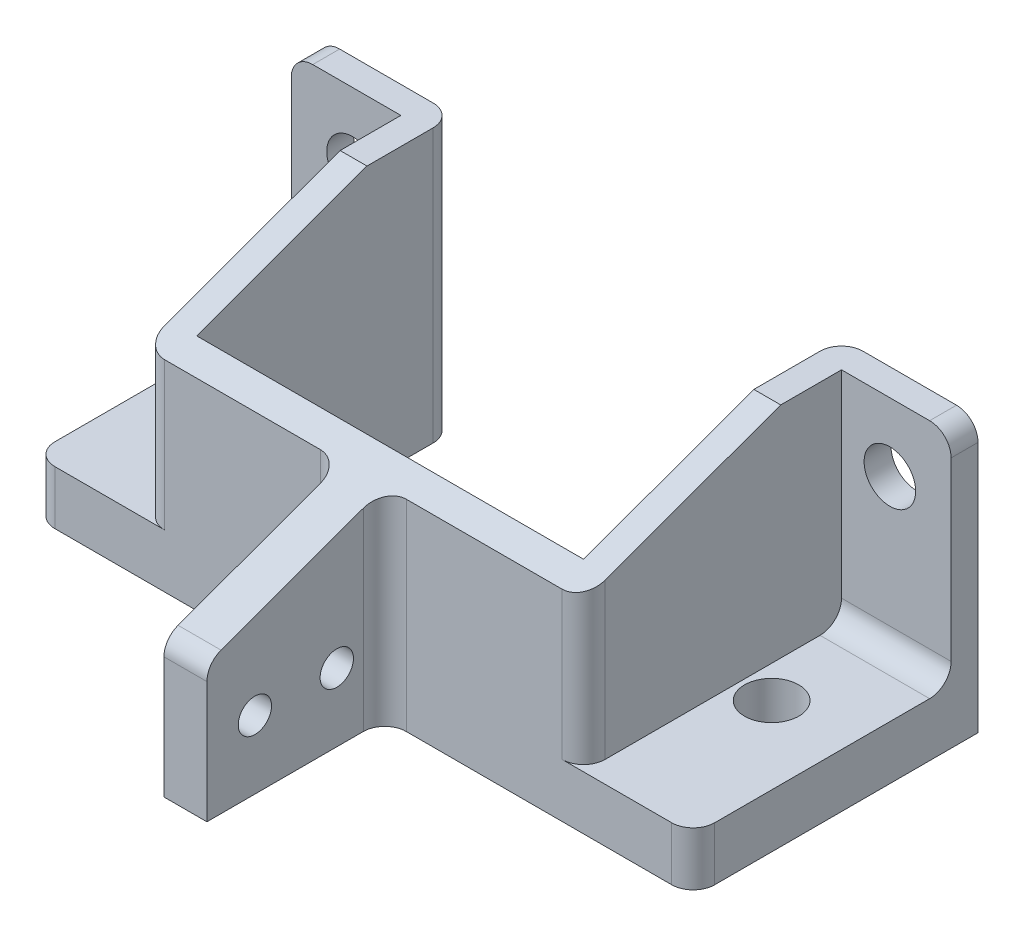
ISO-10303-21;
HEADER;
FILE_DESCRIPTION(('STEP AP214'),'2;1');
FILE_NAME('part.step','',(''),(''),'','','');
FILE_SCHEMA(('AUTOMOTIVE_DESIGN { 1 0 10303 214 1 1 1 1 }'));
ENDSEC;
DATA;
#1=APPLICATION_CONTEXT('core data for automotive mechanical design processes');
#2=APPLICATION_PROTOCOL_DEFINITION('international standard','automotive_design',2000,#1);
#3=PRODUCT_CONTEXT('',#1,'mechanical');
#4=PRODUCT('Part','Part','',(#3));
#5=PRODUCT_RELATED_PRODUCT_CATEGORY('part','',(#4));
#6=PRODUCT_DEFINITION_FORMATION('','',#4);
#7=PRODUCT_DEFINITION_CONTEXT('part definition',#1,'design');
#8=PRODUCT_DEFINITION('design','',#6,#7);
#9=PRODUCT_DEFINITION_SHAPE('','',#8);
#10=(LENGTH_UNIT() NAMED_UNIT(*) SI_UNIT(.MILLI.,.METRE.));
#11=(NAMED_UNIT(*) PLANE_ANGLE_UNIT() SI_UNIT($,.RADIAN.));
#12=(NAMED_UNIT(*) SI_UNIT($,.STERADIAN.) SOLID_ANGLE_UNIT());
#13=UNCERTAINTY_MEASURE_WITH_UNIT(LENGTH_MEASURE(1.E-05),#10,'distance_accuracy_value','');
#14=(GEOMETRIC_REPRESENTATION_CONTEXT(3) GLOBAL_UNCERTAINTY_ASSIGNED_CONTEXT((#13)) GLOBAL_UNIT_ASSIGNED_CONTEXT((#10,
#11,#12)) REPRESENTATION_CONTEXT('',''));
#15=CARTESIAN_POINT('',(0.,0.,0.));
#16=DIRECTION('',(0.,0.,1.));
#17=DIRECTION('',(1.,0.,0.));
#18=AXIS2_PLACEMENT_3D('',#15,#16,#17);
#19=CARTESIAN_POINT('',(0.,25.4,0.));
#20=DIRECTION('',(0.,-1.,0.));
#21=DIRECTION('',(-1.,0.,0.));
#22=AXIS2_PLACEMENT_3D('',#19,#20,#21);
#23=PLANE('',#22);
#24=DIRECTION('',(0.,0.,-1.));
#25=VECTOR('',#24,1.);
#26=CARTESIAN_POINT('',(-18.,25.4,-24.));
#27=LINE('',#26,#25);
#28=CARTESIAN_POINT('',(-18.,25.4,-15.8429632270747));
#29=VERTEX_POINT('',#28);
#30=CARTESIAN_POINT('',(-18.,25.4,-22.));
#31=VERTEX_POINT('',#30);
#32=EDGE_CURVE('E330',#29,#31,#27,.T.);
#33=ORIENTED_EDGE('',*,*,#32,.T.);
#34=CARTESIAN_POINT('',(-20.,25.4,-22.));
#35=DIRECTION('',(0.,-1.,0.));
#36=DIRECTION('',(0.,0.,-1.));
#37=AXIS2_PLACEMENT_3D('',#34,#35,#36);
#38=CIRCLE('',#37,2.);
#39=CARTESIAN_POINT('',(-20.,25.4,-24.));
#40=VERTEX_POINT('',#39);
#41=EDGE_CURVE('E563',#31,#40,#38,.F.);
#42=ORIENTED_EDGE('',*,*,#41,.T.);
#43=DIRECTION('',(-1.,0.,0.));
#44=VECTOR('',#43,1.);
#45=CARTESIAN_POINT('',(-18.,25.4,-24.));
#46=LINE('',#45,#44);
#47=CARTESIAN_POINT('',(-28.7,25.4,-24.));
#48=VERTEX_POINT('',#47);
#49=EDGE_CURVE('E305',#40,#48,#46,.T.);
#50=ORIENTED_EDGE('',*,*,#49,.T.);
#51=DIRECTION('',(0.,0.,-1.));
#52=VECTOR('',#51,1.);
#53=CARTESIAN_POINT('',(-28.7,25.4,-21.5));
#54=LINE('',#53,#52);
#55=CARTESIAN_POINT('',(-28.7,25.4,-21.5));
#56=VERTEX_POINT('',#55);
#57=EDGE_CURVE('E560',#48,#56,#54,.F.);
#58=ORIENTED_EDGE('',*,*,#57,.T.);
#59=DIRECTION('',(-1.,0.,0.));
#60=VECTOR('',#59,1.);
#61=CARTESIAN_POINT('',(-18.,25.4,-21.5));
#62=LINE('',#61,#60);
#63=CARTESIAN_POINT('',(-20.5,25.4,-21.5));
#64=VERTEX_POINT('',#63);
#65=EDGE_CURVE('E308',#64,#56,#62,.T.);
#66=ORIENTED_EDGE('',*,*,#65,.F.);
#67=DIRECTION('',(0.,0.,-1.));
#68=VECTOR('',#67,1.);
#69=CARTESIAN_POINT('',(-20.5,25.4,-24.));
#70=LINE('',#69,#68);
#71=CARTESIAN_POINT('',(-20.5,25.4,-15.8429632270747));
#72=VERTEX_POINT('',#71);
#73=EDGE_CURVE('E313',#72,#64,#70,.T.);
#74=ORIENTED_EDGE('',*,*,#73,.F.);
#75=DIRECTION('',(1.,0.,0.));
#76=VECTOR('',#75,1.);
#77=CARTESIAN_POINT('',(2.,25.4,-15.8429632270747));
#78=LINE('',#77,#76);
#79=EDGE_CURVE('E405',#72,#29,#78,.T.);
#80=ORIENTED_EDGE('',*,*,#79,.T.);
#81=EDGE_LOOP('',(#33,#42,#50,#58,#66,#74,#80));
#82=FACE_BOUND('',#81,.T.);
#83=ADVANCED_FACE('F49',(#82),#23,.F.);
#84=CARTESIAN_POINT('',(20.5,25.4,-24.));
#85=DIRECTION('',(1.,0.,0.));
#86=DIRECTION('',(0.,0.,-1.));
#87=AXIS2_PLACEMENT_3D('',#84,#85,#86);
#88=PLANE('',#87);
#89=DIRECTION('',(0.,0.,1.));
#90=VECTOR('',#89,1.);
#91=CARTESIAN_POINT('',(20.5,5.,-21.5));
#92=LINE('',#91,#90);
#93=CARTESIAN_POINT('',(20.5,5.,-19.5));
#94=VERTEX_POINT('',#93);
#95=CARTESIAN_POINT('',(20.5,5.,0.499999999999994));
#96=VERTEX_POINT('',#95);
#97=EDGE_CURVE('E609',#94,#96,#92,.T.);
#98=ORIENTED_EDGE('',*,*,#97,.F.);
#99=CARTESIAN_POINT('',(20.5,7.,-19.5));
#100=DIRECTION('',(1.,0.,0.));
#101=DIRECTION('',(0.,0.,-1.));
#102=AXIS2_PLACEMENT_3D('',#99,#100,#101);
#103=CIRCLE('',#102,2.);
#104=CARTESIAN_POINT('',(20.5,7.,-21.5));
#105=VERTEX_POINT('',#104);
#106=EDGE_CURVE('E496',#94,#105,#103,.T.);
#107=ORIENTED_EDGE('',*,*,#106,.T.);
#108=DIRECTION('',(0.,-1.,0.));
#109=VECTOR('',#108,1.);
#110=CARTESIAN_POINT('',(20.5,25.4,-21.5));
#111=LINE('',#110,#109);
#112=CARTESIAN_POINT('',(20.5,25.4,-21.5));
#113=VERTEX_POINT('',#112);
#114=EDGE_CURVE('E376',#113,#105,#111,.T.);
#115=ORIENTED_EDGE('',*,*,#114,.F.);
#116=DIRECTION('',(0.,0.,1.));
#117=VECTOR('',#116,1.);
#118=CARTESIAN_POINT('',(20.5,25.4,-24.));
#119=LINE('',#118,#117);
#120=CARTESIAN_POINT('',(20.5,25.4,-15.8429632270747));
#121=VERTEX_POINT('',#120);
#122=EDGE_CURVE('E316',#113,#121,#119,.T.);
#123=ORIENTED_EDGE('',*,*,#122,.T.);
#124=DIRECTION('',(0.,-0.342020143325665,0.93969262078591));
#125=VECTOR('',#124,1.);
#126=CARTESIAN_POINT('',(20.5,28.0216210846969,-23.0458079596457));
#127=LINE('',#126,#125);
#128=CARTESIAN_POINT('',(20.5,19.4516478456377,0.499999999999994));
#129=VERTEX_POINT('',#128);
#130=EDGE_CURVE('E419',#121,#129,#127,.T.);
#131=ORIENTED_EDGE('',*,*,#130,.T.);
#132=DIRECTION('',(0.,-1.,0.));
#133=VECTOR('',#132,1.);
#134=CARTESIAN_POINT('',(20.5,25.4,0.499999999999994));
#135=LINE('',#134,#133);
#136=EDGE_CURVE('E492',#129,#96,#135,.T.);
#137=ORIENTED_EDGE('',*,*,#136,.T.);
#138=EDGE_LOOP('',(#98,#107,#115,#123,#131,#137));
#139=FACE_BOUND('',#138,.T.);
#140=ADVANCED_FACE('F770',(#139),#88,.T.);
#141=CARTESIAN_POINT('',(18.,25.4,-21.5));
#142=DIRECTION('',(0.,0.,1.));
#143=DIRECTION('',(1.,0.,0.));
#144=AXIS2_PLACEMENT_3D('',#141,#142,#143);
#145=PLANE('',#144);
#146=CARTESIAN_POINT('',(25.,19.05,-21.5));
#147=DIRECTION('',(0.,0.,1.));
#148=DIRECTION('',(1.,0.,0.));
#149=AXIS2_PLACEMENT_3D('',#146,#147,#148);
#150=CIRCLE('',#149,2.4);
#151=CARTESIAN_POINT('',(27.4,19.05,-21.5));
#152=VERTEX_POINT('',#151);
#153=EDGE_CURVE('E699',#152,#152,#150,.T.);
#154=ORIENTED_EDGE('',*,*,#153,.F.);
#155=EDGE_LOOP('',(#154));
#156=FACE_BOUND('',#155,.T.);
#157=ORIENTED_EDGE('',*,*,#114,.T.);
#158=DIRECTION('',(-1.,0.,0.));
#159=VECTOR('',#158,1.);
#160=CARTESIAN_POINT('',(18.,7.,-21.5));
#161=LINE('',#160,#159);
#162=CARTESIAN_POINT('',(30.7,7.,-21.5));
#163=VERTEX_POINT('',#162);
#164=EDGE_CURVE('E502',#105,#163,#161,.F.);
#165=ORIENTED_EDGE('',*,*,#164,.T.);
#166=DIRECTION('',(0.,-1.,0.));
#167=VECTOR('',#166,1.);
#168=CARTESIAN_POINT('',(30.7,25.4,-21.5));
#169=LINE('',#168,#167);
#170=CARTESIAN_POINT('',(30.7,23.4,-21.5));
#171=VERTEX_POINT('',#170);
#172=EDGE_CURVE('E372',#171,#163,#169,.T.);
#173=ORIENTED_EDGE('',*,*,#172,.F.);
#174=CARTESIAN_POINT('',(28.7,23.4,-21.5));
#175=DIRECTION('',(0.,0.,1.));
#176=DIRECTION('',(1.,0.,0.));
#177=AXIS2_PLACEMENT_3D('',#174,#175,#176);
#178=CIRCLE('',#177,2.);
#179=CARTESIAN_POINT('',(28.7,25.4,-21.5));
#180=VERTEX_POINT('',#179);
#181=EDGE_CURVE('E499',#171,#180,#178,.T.);
#182=ORIENTED_EDGE('',*,*,#181,.T.);
#183=DIRECTION('',(1.,0.,0.));
#184=VECTOR('',#183,1.);
#185=CARTESIAN_POINT('',(18.,25.4,-21.5));
#186=LINE('',#185,#184);
#187=EDGE_CURVE('E320',#180,#113,#186,.F.);
#188=ORIENTED_EDGE('',*,*,#187,.T.);
#189=EDGE_LOOP('',(#157,#165,#173,#182,#188));
#190=FACE_BOUND('',#189,.T.);
#191=ADVANCED_FACE('F766',(#156,#190),#145,.T.);
#192=CARTESIAN_POINT('',(-18.,25.4,2.5));
#193=DIRECTION('',(0.,0.,1.));
#194=DIRECTION('',(1.,0.,0.));
#195=AXIS2_PLACEMENT_3D('',#192,#193,#194);
#196=PLANE('',#195);
#197=DIRECTION('',(-1.,0.,0.));
#198=VECTOR('',#197,1.);
#199=CARTESIAN_POINT('',(-18.,0.,2.5));
#200=LINE('',#199,#198);
#201=CARTESIAN_POINT('',(-4.,0.,2.5));
#202=VERTEX_POINT('',#201);
#203=CARTESIAN_POINT('',(-28.7,0.,2.5));
#204=VERTEX_POINT('',#203);
#205=EDGE_CURVE('E341',#202,#204,#200,.T.);
#206=ORIENTED_EDGE('',*,*,#205,.F.);
#207=DIRECTION('',(0.,1.,0.));
#208=VECTOR('',#207,1.);
#209=CARTESIAN_POINT('',(-4.,25.4,2.5));
#210=LINE('',#209,#208);
#211=CARTESIAN_POINT('',(-4.,18.7237073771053,2.5));
#212=VERTEX_POINT('',#211);
#213=EDGE_CURVE('E472',#202,#212,#210,.T.);
#214=ORIENTED_EDGE('',*,*,#213,.T.);
#215=DIRECTION('',(-1.,0.,0.));
#216=VECTOR('',#215,1.);
#217=CARTESIAN_POINT('',(-18.,18.7237073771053,2.5));
#218=LINE('',#217,#216);
#219=CARTESIAN_POINT('',(-18.5,18.7237073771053,2.5));
#220=VERTEX_POINT('',#219);
#221=EDGE_CURVE('E434',#212,#220,#218,.T.);
#222=ORIENTED_EDGE('',*,*,#221,.T.);
#223=DIRECTION('',(0.,-1.,0.));
#224=VECTOR('',#223,1.);
#225=CARTESIAN_POINT('',(-18.5,25.4,2.5));
#226=LINE('',#225,#224);
#227=CARTESIAN_POINT('',(-18.5,5.,2.5));
#228=VERTEX_POINT('',#227);
#229=EDGE_CURVE('E468',#220,#228,#226,.T.);
#230=ORIENTED_EDGE('',*,*,#229,.T.);
#231=DIRECTION('',(1.,0.,0.));
#232=VECTOR('',#231,1.);
#233=CARTESIAN_POINT('',(-30.7,5.,2.5));
#234=LINE('',#233,#232);
#235=CARTESIAN_POINT('',(-28.7,5.,2.5));
#236=VERTEX_POINT('',#235);
#237=EDGE_CURVE('E658',#236,#228,#234,.T.);
#238=ORIENTED_EDGE('',*,*,#237,.F.);
#239=DIRECTION('',(0.,-1.,0.));
#240=VECTOR('',#239,1.);
#241=CARTESIAN_POINT('',(-28.7,25.4,2.5));
#242=LINE('',#241,#240);
#243=EDGE_CURVE('E464',#236,#204,#242,.T.);
#244=ORIENTED_EDGE('',*,*,#243,.T.);
#245=EDGE_LOOP('',(#206,#214,#222,#230,#238,#244));
#246=FACE_BOUND('',#245,.T.);
#247=ADVANCED_FACE('F639',(#246),#196,.T.);
#248=CARTESIAN_POINT('',(-18.,25.4,-24.));
#249=DIRECTION('',(0.,0.,1.));
#250=DIRECTION('',(1.,0.,0.));
#251=AXIS2_PLACEMENT_3D('',#248,#249,#250);
#252=PLANE('',#251);
#253=CARTESIAN_POINT('',(-25.,19.05,-24.));
#254=DIRECTION('',(0.,0.,1.));
#255=DIRECTION('',(1.,0.,0.));
#256=AXIS2_PLACEMENT_3D('',#253,#254,#255);
#257=CIRCLE('',#256,2.4);
#258=CARTESIAN_POINT('',(-22.6,19.05,-24.));
#259=VERTEX_POINT('',#258);
#260=EDGE_CURVE('E703',#259,#259,#257,.T.);
#261=ORIENTED_EDGE('',*,*,#260,.T.);
#262=EDGE_LOOP('',(#261));
#263=FACE_BOUND('',#262,.T.);
#264=ORIENTED_EDGE('',*,*,#49,.F.);
#265=DIRECTION('',(0.,-1.,0.));
#266=VECTOR('',#265,1.);
#267=CARTESIAN_POINT('',(-20.,25.4,-24.));
#268=LINE('',#267,#266);
#269=CARTESIAN_POINT('',(-20.,0.,-24.));
#270=VERTEX_POINT('',#269);
#271=EDGE_CURVE('E554',#40,#270,#268,.T.);
#272=ORIENTED_EDGE('',*,*,#271,.T.);
#273=DIRECTION('',(-1.,0.,0.));
#274=VECTOR('',#273,1.);
#275=CARTESIAN_POINT('',(-18.,0.,-24.));
#276=LINE('',#275,#274);
#277=CARTESIAN_POINT('',(-30.7,0.,-24.));
#278=VERTEX_POINT('',#277);
#279=EDGE_CURVE('E289',#270,#278,#276,.T.);
#280=ORIENTED_EDGE('',*,*,#279,.T.);
#281=DIRECTION('',(0.,-1.,0.));
#282=VECTOR('',#281,1.);
#283=CARTESIAN_POINT('',(-30.7,25.4,-24.));
#284=LINE('',#283,#282);
#285=CARTESIAN_POINT('',(-30.7,23.4,-24.));
#286=VERTEX_POINT('',#285);
#287=EDGE_CURVE('E388',#286,#278,#284,.T.);
#288=ORIENTED_EDGE('',*,*,#287,.F.);
#289=CARTESIAN_POINT('',(-28.7,23.4,-24.));
#290=DIRECTION('',(0.,0.,1.));
#291=DIRECTION('',(1.,0.,0.));
#292=AXIS2_PLACEMENT_3D('',#289,#290,#291);
#293=CIRCLE('',#292,2.);
#294=EDGE_CURVE('E73',#286,#48,#293,.F.);
#295=ORIENTED_EDGE('',*,*,#294,.T.);
#296=EDGE_LOOP('',(#264,#272,#280,#288,#295));
#297=FACE_BOUND('',#296,.T.);
#298=ADVANCED_FACE('F757',(#263,#297),#252,.F.);
#299=CARTESIAN_POINT('',(-30.7,25.4,-21.5));
#300=DIRECTION('',(-1.,0.,0.));
#301=DIRECTION('',(0.,0.,1.));
#302=AXIS2_PLACEMENT_3D('',#299,#300,#301);
#303=PLANE('',#302);
#304=DIRECTION('',(0.,-1.,0.));
#305=VECTOR('',#304,1.);
#306=CARTESIAN_POINT('',(-30.7,25.4,-21.5));
#307=LINE('',#306,#305);
#308=CARTESIAN_POINT('',(-30.7,23.4,-21.5));
#309=VERTEX_POINT('',#308);
#310=CARTESIAN_POINT('',(-30.7,7.,-21.5));
#311=VERTEX_POINT('',#310);
#312=EDGE_CURVE('E384',#309,#311,#307,.T.);
#313=ORIENTED_EDGE('',*,*,#312,.F.);
#314=DIRECTION('',(0.,0.,-1.));
#315=VECTOR('',#314,1.);
#316=CARTESIAN_POINT('',(-30.7,23.4,-24.));
#317=LINE('',#316,#315);
#318=EDGE_CURVE('E569',#309,#286,#317,.T.);
#319=ORIENTED_EDGE('',*,*,#318,.T.);
#320=ORIENTED_EDGE('',*,*,#287,.T.);
#321=DIRECTION('',(0.,0.,-1.));
#322=VECTOR('',#321,1.);
#323=CARTESIAN_POINT('',(-30.7,0.,-21.5));
#324=LINE('',#323,#322);
#325=CARTESIAN_POINT('',(-30.7,0.,0.5));
#326=VERTEX_POINT('',#325);
#327=EDGE_CURVE('E337',#326,#278,#324,.T.);
#328=ORIENTED_EDGE('',*,*,#327,.F.);
#329=DIRECTION('',(0.,-1.,0.));
#330=VECTOR('',#329,1.);
#331=CARTESIAN_POINT('',(-30.7,25.4,0.5));
#332=LINE('',#331,#330);
#333=CARTESIAN_POINT('',(-30.7,5.,0.5));
#334=VERTEX_POINT('',#333);
#335=EDGE_CURVE('E566',#326,#334,#332,.F.);
#336=ORIENTED_EDGE('',*,*,#335,.T.);
#337=DIRECTION('',(0.,0.,1.));
#338=VECTOR('',#337,1.);
#339=CARTESIAN_POINT('',(-30.7,5.,-21.5));
#340=LINE('',#339,#338);
#341=CARTESIAN_POINT('',(-30.7,5.,-19.5));
#342=VERTEX_POINT('',#341);
#343=EDGE_CURVE('E660',#342,#334,#340,.T.);
#344=ORIENTED_EDGE('',*,*,#343,.F.);
#345=CARTESIAN_POINT('',(-30.7,7.,-19.5));
#346=DIRECTION('',(-1.,0.,0.));
#347=DIRECTION('',(0.,0.,1.));
#348=AXIS2_PLACEMENT_3D('',#345,#346,#347);
#349=CIRCLE('',#348,2.);
#350=EDGE_CURVE('E596',#342,#311,#349,.F.);
#351=ORIENTED_EDGE('',*,*,#350,.T.);
#352=EDGE_LOOP('',(#313,#319,#320,#328,#336,#344,#351));
#353=FACE_BOUND('',#352,.T.);
#354=ADVANCED_FACE('F651',(#353),#303,.T.);
#355=CARTESIAN_POINT('',(-18.,25.4,-21.5));
#356=DIRECTION('',(0.,0.,1.));
#357=DIRECTION('',(1.,0.,0.));
#358=AXIS2_PLACEMENT_3D('',#355,#356,#357);
#359=PLANE('',#358);
#360=CARTESIAN_POINT('',(-25.,19.05,-21.5));
#361=DIRECTION('',(0.,0.,1.));
#362=DIRECTION('',(1.,0.,0.));
#363=AXIS2_PLACEMENT_3D('',#360,#361,#362);
#364=CIRCLE('',#363,2.4);
#365=CARTESIAN_POINT('',(-22.6,19.05,-21.5));
#366=VERTEX_POINT('',#365);
#367=EDGE_CURVE('E707',#366,#366,#364,.T.);
#368=ORIENTED_EDGE('',*,*,#367,.F.);
#369=EDGE_LOOP('',(#368));
#370=FACE_BOUND('',#369,.T.);
#371=ORIENTED_EDGE('',*,*,#312,.T.);
#372=DIRECTION('',(-1.,0.,0.));
#373=VECTOR('',#372,1.);
#374=CARTESIAN_POINT('',(-20.5,7.,-21.5));
#375=LINE('',#374,#373);
#376=CARTESIAN_POINT('',(-20.5,7.,-21.5));
#377=VERTEX_POINT('',#376);
#378=EDGE_CURVE('E515',#311,#377,#375,.F.);
#379=ORIENTED_EDGE('',*,*,#378,.T.);
#380=DIRECTION('',(0.,-1.,0.));
#381=VECTOR('',#380,1.);
#382=CARTESIAN_POINT('',(-20.5,25.4,-21.5));
#383=LINE('',#382,#381);
#384=EDGE_CURVE('E380',#64,#377,#383,.T.);
#385=ORIENTED_EDGE('',*,*,#384,.F.);
#386=ORIENTED_EDGE('',*,*,#65,.T.);
#387=CARTESIAN_POINT('',(-28.7,23.4,-21.5));
#388=DIRECTION('',(0.,0.,1.));
#389=DIRECTION('',(1.,0.,0.));
#390=AXIS2_PLACEMENT_3D('',#387,#388,#389);
#391=CIRCLE('',#390,2.);
#392=EDGE_CURVE('E512',#56,#309,#391,.T.);
#393=ORIENTED_EDGE('',*,*,#392,.T.);
#394=EDGE_LOOP('',(#371,#379,#385,#386,#393));
#395=FACE_BOUND('',#394,.T.);
#396=ADVANCED_FACE('F714',(#370,#395),#359,.T.);
#397=CARTESIAN_POINT('',(-20.5,25.4,-24.));
#398=DIRECTION('',(-1.,0.,0.));
#399=DIRECTION('',(0.,0.,1.));
#400=AXIS2_PLACEMENT_3D('',#397,#398,#399);
#401=PLANE('',#400);
#402=ORIENTED_EDGE('',*,*,#384,.T.);
#403=CARTESIAN_POINT('',(-20.5,7.,-19.5));
#404=DIRECTION('',(-1.,0.,0.));
#405=DIRECTION('',(0.,0.,1.));
#406=AXIS2_PLACEMENT_3D('',#403,#404,#405);
#407=CIRCLE('',#406,2.);
#408=CARTESIAN_POINT('',(-20.5,5.,-19.5));
#409=VERTEX_POINT('',#408);
#410=EDGE_CURVE('E521',#377,#409,#407,.T.);
#411=ORIENTED_EDGE('',*,*,#410,.T.);
#412=DIRECTION('',(0.,0.,-1.));
#413=VECTOR('',#412,1.);
#414=CARTESIAN_POINT('',(-20.5,5.,-21.5));
#415=LINE('',#414,#413);
#416=CARTESIAN_POINT('',(-20.5,5.,0.5));
#417=VERTEX_POINT('',#416);
#418=EDGE_CURVE('E279',#417,#409,#415,.T.);
#419=ORIENTED_EDGE('',*,*,#418,.F.);
#420=DIRECTION('',(0.,-1.,0.));
#421=VECTOR('',#420,1.);
#422=CARTESIAN_POINT('',(-20.5,25.4,0.5));
#423=LINE('',#422,#421);
#424=CARTESIAN_POINT('',(-20.5,19.4516478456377,0.5));
#425=VERTEX_POINT('',#424);
#426=EDGE_CURVE('E518',#417,#425,#423,.F.);
#427=ORIENTED_EDGE('',*,*,#426,.T.);
#428=DIRECTION('',(0.,0.342020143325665,-0.93969262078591));
#429=VECTOR('',#428,1.);
#430=CARTESIAN_POINT('',(-20.5,28.0216210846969,-23.0458079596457));
#431=LINE('',#430,#429);
#432=EDGE_CURVE('E438',#425,#72,#431,.T.);
#433=ORIENTED_EDGE('',*,*,#432,.T.);
#434=ORIENTED_EDGE('',*,*,#73,.T.);
#435=EDGE_LOOP('',(#402,#411,#419,#427,#433,#434));
#436=FACE_BOUND('',#435,.T.);
#437=ADVANCED_FACE('F717',(#436),#401,.T.);
#438=DIRECTION('',(-1.,0.,0.));
#439=VECTOR('',#438,1.);
#440=CARTESIAN_POINT('',(-18.,18.7237073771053,2.5));
#441=LINE('',#440,#439);
#442=CARTESIAN_POINT('',(18.5,18.7237073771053,2.49999999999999));
#443=VERTEX_POINT('',#442);
#444=CARTESIAN_POINT('',(4.,18.7237073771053,2.5));
#445=VERTEX_POINT('',#444);
#446=EDGE_CURVE('E423',#443,#445,#441,.T.);
#447=ORIENTED_EDGE('',*,*,#446,.T.);
#448=DIRECTION('',(0.,1.,0.));
#449=VECTOR('',#448,1.);
#450=CARTESIAN_POINT('',(4.,0.,2.5));
#451=LINE('',#450,#449);
#452=CARTESIAN_POINT('',(4.,0.,2.5));
#453=VERTEX_POINT('',#452);
#454=EDGE_CURVE('E482',#445,#453,#451,.F.);
#455=ORIENTED_EDGE('',*,*,#454,.T.);
#456=CARTESIAN_POINT('',(28.7,0.,2.49999999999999));
#457=VERTEX_POINT('',#456);
#458=EDGE_CURVE('E342',#457,#453,#200,.T.);
#459=ORIENTED_EDGE('',*,*,#458,.F.);
#460=DIRECTION('',(0.,-1.,0.));
#461=VECTOR('',#460,1.);
#462=CARTESIAN_POINT('',(28.7,25.4,2.49999999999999));
#463=LINE('',#462,#461);
#464=CARTESIAN_POINT('',(28.7,5.,2.49999999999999));
#465=VERTEX_POINT('',#464);
#466=EDGE_CURVE('E476',#457,#465,#463,.F.);
#467=ORIENTED_EDGE('',*,*,#466,.T.);
#468=DIRECTION('',(1.,0.,0.));
#469=VECTOR('',#468,1.);
#470=CARTESIAN_POINT('',(30.7,5.,2.49999999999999));
#471=LINE('',#470,#469);
#472=CARTESIAN_POINT('',(18.5,5.,2.49999999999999));
#473=VERTEX_POINT('',#472);
#474=EDGE_CURVE('E606',#473,#465,#471,.T.);
#475=ORIENTED_EDGE('',*,*,#474,.F.);
#476=DIRECTION('',(0.,-1.,0.));
#477=VECTOR('',#476,1.);
#478=CARTESIAN_POINT('',(18.5,25.4,2.49999999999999));
#479=LINE('',#478,#477);
#480=EDGE_CURVE('E479',#473,#443,#479,.F.);
#481=ORIENTED_EDGE('',*,*,#480,.T.);
#482=EDGE_LOOP('',(#447,#455,#459,#467,#475,#481));
#483=FACE_BOUND('',#482,.T.);
#484=ADVANCED_FACE('F616',(#483),#196,.T.);
#485=CARTESIAN_POINT('',(30.7,25.4,-24.));
#486=DIRECTION('',(1.,0.,0.));
#487=DIRECTION('',(0.,0.,-1.));
#488=AXIS2_PLACEMENT_3D('',#485,#486,#487);
#489=PLANE('',#488);
#490=DIRECTION('',(0.,-1.,0.));
#491=VECTOR('',#490,1.);
#492=CARTESIAN_POINT('',(30.7,25.4,-24.));
#493=LINE('',#492,#491);
#494=CARTESIAN_POINT('',(30.7,23.4,-24.));
#495=VERTEX_POINT('',#494);
#496=CARTESIAN_POINT('',(30.7,0.,-24.));
#497=VERTEX_POINT('',#496);
#498=EDGE_CURVE('E369',#495,#497,#493,.T.);
#499=ORIENTED_EDGE('',*,*,#498,.F.);
#500=DIRECTION('',(0.,0.,1.));
#501=VECTOR('',#500,1.);
#502=CARTESIAN_POINT('',(30.7,23.4,-21.5));
#503=LINE('',#502,#501);
#504=EDGE_CURVE('E577',#495,#171,#503,.T.);
#505=ORIENTED_EDGE('',*,*,#504,.T.);
#506=ORIENTED_EDGE('',*,*,#172,.T.);
#507=CARTESIAN_POINT('',(30.7,7.,-19.5));
#508=DIRECTION('',(1.,0.,0.));
#509=DIRECTION('',(0.,0.,-1.));
#510=AXIS2_PLACEMENT_3D('',#507,#508,#509);
#511=CIRCLE('',#510,2.);
#512=CARTESIAN_POINT('',(30.7,5.,-19.5));
#513=VERTEX_POINT('',#512);
#514=EDGE_CURVE('E593',#163,#513,#511,.F.);
#515=ORIENTED_EDGE('',*,*,#514,.T.);
#516=DIRECTION('',(0.,0.,-1.));
#517=VECTOR('',#516,1.);
#518=CARTESIAN_POINT('',(30.7,5.,-21.5));
#519=LINE('',#518,#517);
#520=CARTESIAN_POINT('',(30.7,5.,0.499999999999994));
#521=VERTEX_POINT('',#520);
#522=EDGE_CURVE('E665',#521,#513,#519,.T.);
#523=ORIENTED_EDGE('',*,*,#522,.F.);
#524=DIRECTION('',(0.,-1.,0.));
#525=VECTOR('',#524,1.);
#526=CARTESIAN_POINT('',(30.7,25.4,0.499999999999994));
#527=LINE('',#526,#525);
#528=CARTESIAN_POINT('',(30.7,0.,0.499999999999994));
#529=VERTEX_POINT('',#528);
#530=EDGE_CURVE('E573',#521,#529,#527,.T.);
#531=ORIENTED_EDGE('',*,*,#530,.T.);
#532=DIRECTION('',(0.,0.,1.));
#533=VECTOR('',#532,1.);
#534=CARTESIAN_POINT('',(30.7,0.,-24.));
#535=LINE('',#534,#533);
#536=EDGE_CURVE('E346',#497,#529,#535,.T.);
#537=ORIENTED_EDGE('',*,*,#536,.F.);
#538=EDGE_LOOP('',(#499,#505,#506,#515,#523,#531,#537));
#539=FACE_BOUND('',#538,.T.);
#540=ADVANCED_FACE('F804',(#539),#489,.T.);
#541=CARTESIAN_POINT('',(18.,25.4,-24.));
#542=DIRECTION('',(0.,0.,1.));
#543=DIRECTION('',(1.,0.,0.));
#544=AXIS2_PLACEMENT_3D('',#541,#542,#543);
#545=PLANE('',#544);
#546=CARTESIAN_POINT('',(25.,19.05,-24.));
#547=DIRECTION('',(0.,0.,1.));
#548=DIRECTION('',(1.,0.,0.));
#549=AXIS2_PLACEMENT_3D('',#546,#547,#548);
#550=CIRCLE('',#549,2.4);
#551=CARTESIAN_POINT('',(27.4,19.05,-24.));
#552=VERTEX_POINT('',#551);
#553=EDGE_CURVE('E695',#552,#552,#550,.T.);
#554=ORIENTED_EDGE('',*,*,#553,.T.);
#555=EDGE_LOOP('',(#554));
#556=FACE_BOUND('',#555,.T.);
#557=DIRECTION('',(-1.,0.,0.));
#558=VECTOR('',#557,1.);
#559=CARTESIAN_POINT('',(18.,0.,-24.));
#560=LINE('',#559,#558);
#561=CARTESIAN_POINT('',(20.,0.,-24.));
#562=VERTEX_POINT('',#561);
#563=EDGE_CURVE('E350',#497,#562,#560,.T.);
#564=ORIENTED_EDGE('',*,*,#563,.T.);
#565=DIRECTION('',(0.,-1.,0.));
#566=VECTOR('',#565,1.);
#567=CARTESIAN_POINT('',(20.,25.4,-24.));
#568=LINE('',#567,#566);
#569=CARTESIAN_POINT('',(20.,25.4,-24.));
#570=VERTEX_POINT('',#569);
#571=EDGE_CURVE('E543',#562,#570,#568,.F.);
#572=ORIENTED_EDGE('',*,*,#571,.T.);
#573=DIRECTION('',(-1.,0.,0.));
#574=VECTOR('',#573,1.);
#575=CARTESIAN_POINT('',(18.,25.4,-24.));
#576=LINE('',#575,#574);
#577=CARTESIAN_POINT('',(28.7,25.4,-24.));
#578=VERTEX_POINT('',#577);
#579=EDGE_CURVE('E323',#578,#570,#576,.T.);
#580=ORIENTED_EDGE('',*,*,#579,.F.);
#581=CARTESIAN_POINT('',(28.7,23.4,-24.));
#582=DIRECTION('',(0.,0.,1.));
#583=DIRECTION('',(1.,0.,0.));
#584=AXIS2_PLACEMENT_3D('',#581,#582,#583);
#585=CIRCLE('',#584,2.);
#586=EDGE_CURVE('E540',#578,#495,#585,.F.);
#587=ORIENTED_EDGE('',*,*,#586,.T.);
#588=ORIENTED_EDGE('',*,*,#498,.T.);
#589=EDGE_LOOP('',(#564,#572,#580,#587,#588));
#590=FACE_BOUND('',#589,.T.);
#591=ADVANCED_FACE('F800',(#556,#590),#545,.F.);
#592=CARTESIAN_POINT('',(18.,25.4,-24.));
#593=DIRECTION('',(1.,0.,0.));
#594=DIRECTION('',(0.,0.,-1.));
#595=AXIS2_PLACEMENT_3D('',#592,#593,#594);
#596=PLANE('',#595);
#597=DIRECTION('',(0.,0.,1.));
#598=VECTOR('',#597,1.);
#599=CARTESIAN_POINT('',(18.,25.4,-24.));
#600=LINE('',#599,#598);
#601=CARTESIAN_POINT('',(18.,25.4,-22.));
#602=VERTEX_POINT('',#601);
#603=CARTESIAN_POINT('',(18.,25.4,-15.8429632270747));
#604=VERTEX_POINT('',#603);
#605=EDGE_CURVE('E327',#602,#604,#600,.T.);
#606=ORIENTED_EDGE('',*,*,#605,.F.);
#607=DIRECTION('',(0.,-1.,0.));
#608=VECTOR('',#607,1.);
#609=CARTESIAN_POINT('',(18.,25.4,-22.));
#610=LINE('',#609,#608);
#611=CARTESIAN_POINT('',(18.,0.,-22.));
#612=VERTEX_POINT('',#611);
#613=EDGE_CURVE('E524',#602,#612,#610,.T.);
#614=ORIENTED_EDGE('',*,*,#613,.T.);
#615=DIRECTION('',(0.,0.,1.));
#616=VECTOR('',#615,1.);
#617=CARTESIAN_POINT('',(18.,0.,-24.));
#618=LINE('',#617,#616);
#619=CARTESIAN_POINT('',(18.,0.,0.));
#620=VERTEX_POINT('',#619);
#621=EDGE_CURVE('E354',#612,#620,#618,.T.);
#622=ORIENTED_EDGE('',*,*,#621,.T.);
#623=DIRECTION('',(0.,-1.,0.));
#624=VECTOR('',#623,1.);
#625=CARTESIAN_POINT('',(18.,25.4,0.));
#626=LINE('',#625,#624);
#627=CARTESIAN_POINT('',(18.,19.6336329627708,0.));
#628=VERTEX_POINT('',#627);
#629=EDGE_CURVE('E365',#628,#620,#626,.T.);
#630=ORIENTED_EDGE('',*,*,#629,.F.);
#631=DIRECTION('',(0.,0.342020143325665,-0.93969262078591));
#632=VECTOR('',#631,1.);
#633=CARTESIAN_POINT('',(18.,25.4,-15.8429632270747));
#634=LINE('',#633,#632);
#635=EDGE_CURVE('E415',#628,#604,#634,.T.);
#636=ORIENTED_EDGE('',*,*,#635,.T.);
#637=EDGE_LOOP('',(#606,#614,#622,#630,#636));
#638=FACE_BOUND('',#637,.T.);
#639=ADVANCED_FACE('F751',(#638),#596,.F.);
#640=CARTESIAN_POINT('',(-18.,25.4,0.));
#641=DIRECTION('',(0.,0.,1.));
#642=DIRECTION('',(1.,0.,0.));
#643=AXIS2_PLACEMENT_3D('',#640,#641,#642);
#644=PLANE('',#643);
#645=DIRECTION('',(0.,-1.,0.));
#646=VECTOR('',#645,1.);
#647=CARTESIAN_POINT('',(-18.,25.4,0.));
#648=LINE('',#647,#646);
#649=CARTESIAN_POINT('',(-18.,19.6336329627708,0.));
#650=VERTEX_POINT('',#649);
#651=CARTESIAN_POINT('',(-18.,0.,0.));
#652=VERTEX_POINT('',#651);
#653=EDGE_CURVE('E333',#650,#652,#648,.T.);
#654=ORIENTED_EDGE('',*,*,#653,.F.);
#655=DIRECTION('',(1.,0.,0.));
#656=VECTOR('',#655,1.);
#657=CARTESIAN_POINT('',(0.,19.6336329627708,0.));
#658=LINE('',#657,#656);
#659=EDGE_CURVE('E412',#650,#628,#658,.T.);
#660=ORIENTED_EDGE('',*,*,#659,.T.);
#661=ORIENTED_EDGE('',*,*,#629,.T.);
#662=DIRECTION('',(-1.,0.,0.));
#663=VECTOR('',#662,1.);
#664=CARTESIAN_POINT('',(-18.,0.,0.));
#665=LINE('',#664,#663);
#666=EDGE_CURVE('E357',#620,#652,#665,.T.);
#667=ORIENTED_EDGE('',*,*,#666,.T.);
#668=EDGE_LOOP('',(#654,#660,#661,#667));
#669=FACE_BOUND('',#668,.T.);
#670=ADVANCED_FACE('F743',(#669),#644,.F.);
#671=CARTESIAN_POINT('',(-18.,25.4,-24.));
#672=DIRECTION('',(-1.,0.,0.));
#673=DIRECTION('',(0.,0.,1.));
#674=AXIS2_PLACEMENT_3D('',#671,#672,#673);
#675=PLANE('',#674);
#676=DIRECTION('',(0.,0.,-1.));
#677=VECTOR('',#676,1.);
#678=CARTESIAN_POINT('',(-18.,0.,-24.));
#679=LINE('',#678,#677);
#680=CARTESIAN_POINT('',(-18.,0.,-22.));
#681=VERTEX_POINT('',#680);
#682=EDGE_CURVE('E309',#652,#681,#679,.T.);
#683=ORIENTED_EDGE('',*,*,#682,.T.);
#684=DIRECTION('',(0.,-1.,0.));
#685=VECTOR('',#684,1.);
#686=CARTESIAN_POINT('',(-18.,25.4,-22.));
#687=LINE('',#686,#685);
#688=EDGE_CURVE('E65',#681,#31,#687,.F.);
#689=ORIENTED_EDGE('',*,*,#688,.T.);
#690=ORIENTED_EDGE('',*,*,#32,.F.);
#691=DIRECTION('',(0.,-0.342020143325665,0.93969262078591));
#692=VECTOR('',#691,1.);
#693=CARTESIAN_POINT('',(-18.,25.4,-15.8429632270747));
#694=LINE('',#693,#692);
#695=EDGE_CURVE('E409',#29,#650,#694,.T.);
#696=ORIENTED_EDGE('',*,*,#695,.T.);
#697=ORIENTED_EDGE('',*,*,#653,.T.);
#698=EDGE_LOOP('',(#683,#689,#690,#696,#697));
#699=FACE_BOUND('',#698,.T.);
#700=ADVANCED_FACE('F740',(#699),#675,.F.);
#701=ORIENTED_EDGE('',*,*,#579,.T.);
#702=CARTESIAN_POINT('',(20.,25.4,-22.));
#703=DIRECTION('',(0.,-1.,0.));
#704=DIRECTION('',(0.,0.,-1.));
#705=AXIS2_PLACEMENT_3D('',#702,#703,#704);
#706=CIRCLE('',#705,2.);
#707=EDGE_CURVE('E549',#570,#602,#706,.F.);
#708=ORIENTED_EDGE('',*,*,#707,.T.);
#709=ORIENTED_EDGE('',*,*,#605,.T.);
#710=DIRECTION('',(1.,0.,0.));
#711=VECTOR('',#710,1.);
#712=CARTESIAN_POINT('',(2.,25.4,-15.8429632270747));
#713=LINE('',#712,#711);
#714=EDGE_CURVE('E391',#604,#121,#713,.T.);
#715=ORIENTED_EDGE('',*,*,#714,.T.);
#716=ORIENTED_EDGE('',*,*,#122,.F.);
#717=ORIENTED_EDGE('',*,*,#187,.F.);
#718=DIRECTION('',(0.,0.,1.));
#719=VECTOR('',#718,1.);
#720=CARTESIAN_POINT('',(28.7,25.4,-24.));
#721=LINE('',#720,#719);
#722=EDGE_CURVE('E546',#180,#578,#721,.F.);
#723=ORIENTED_EDGE('',*,*,#722,.T.);
#724=EDGE_LOOP('',(#701,#708,#709,#715,#716,#717,#723));
#725=FACE_BOUND('',#724,.T.);
#726=ADVANCED_FACE('F772',(#725),#23,.F.);
#727=CARTESIAN_POINT('',(0.,0.,0.));
#728=DIRECTION('',(0.,-1.,0.));
#729=DIRECTION('',(-1.,0.,0.));
#730=AXIS2_PLACEMENT_3D('',#727,#728,#729);
#731=PLANE('',#730);
#732=CARTESIAN_POINT('',(23.5,0.,-12.));
#733=DIRECTION('',(0.,-1.,0.));
#734=DIRECTION('',(0.,0.,-1.));
#735=AXIS2_PLACEMENT_3D('',#732,#733,#734);
#736=CIRCLE('',#735,2.5273);
#737=CARTESIAN_POINT('',(23.5,0.,-14.5273));
#738=VERTEX_POINT('',#737);
#739=EDGE_CURVE('E396',#738,#738,#736,.T.);
#740=ORIENTED_EDGE('',*,*,#739,.F.);
#741=EDGE_LOOP('',(#740));
#742=FACE_BOUND('',#741,.T.);
#743=CARTESIAN_POINT('',(-23.5,0.,-12.));
#744=DIRECTION('',(0.,-1.,0.));
#745=DIRECTION('',(0.,0.,-1.));
#746=AXIS2_PLACEMENT_3D('',#743,#744,#745);
#747=CIRCLE('',#746,2.5273);
#748=CARTESIAN_POINT('',(-23.5,0.,-14.5273));
#749=VERTEX_POINT('',#748);
#750=EDGE_CURVE('E678',#749,#749,#747,.T.);
#751=ORIENTED_EDGE('',*,*,#750,.F.);
#752=EDGE_LOOP('',(#751));
#753=FACE_BOUND('',#752,.T.);
#754=ORIENTED_EDGE('',*,*,#621,.F.);
#755=CARTESIAN_POINT('',(20.,0.,-22.));
#756=DIRECTION('',(0.,-1.,0.));
#757=DIRECTION('',(0.,0.,-1.));
#758=AXIS2_PLACEMENT_3D('',#755,#756,#757);
#759=CIRCLE('',#758,2.);
#760=EDGE_CURVE('E537',#612,#562,#759,.T.);
#761=ORIENTED_EDGE('',*,*,#760,.T.);
#762=ORIENTED_EDGE('',*,*,#563,.F.);
#763=ORIENTED_EDGE('',*,*,#536,.T.);
#764=CARTESIAN_POINT('',(28.7,0.,0.499999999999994));
#765=DIRECTION('',(0.,-1.,0.));
#766=DIRECTION('',(0.,0.,-1.));
#767=AXIS2_PLACEMENT_3D('',#764,#765,#766);
#768=CIRCLE('',#767,2.);
#769=EDGE_CURVE('E531',#529,#457,#768,.T.);
#770=ORIENTED_EDGE('',*,*,#769,.T.);
#771=ORIENTED_EDGE('',*,*,#458,.T.);
#772=CARTESIAN_POINT('',(4.,0.,4.5));
#773=DIRECTION('',(0.,-1.,0.));
#774=DIRECTION('',(0.,0.,-1.));
#775=AXIS2_PLACEMENT_3D('',#772,#773,#774);
#776=CIRCLE('',#775,2.);
#777=CARTESIAN_POINT('',(2.,0.,4.5));
#778=VERTEX_POINT('',#777);
#779=EDGE_CURVE('E590',#453,#778,#776,.F.);
#780=ORIENTED_EDGE('',*,*,#779,.T.);
#781=DIRECTION('',(0.,0.,1.));
#782=VECTOR('',#781,1.);
#783=CARTESIAN_POINT('',(2.,0.,0.));
#784=LINE('',#783,#782);
#785=CARTESIAN_POINT('',(2.,0.,19.05));
#786=VERTEX_POINT('',#785);
#787=EDGE_CURVE('E295',#778,#786,#784,.T.);
#788=ORIENTED_EDGE('',*,*,#787,.T.);
#789=DIRECTION('',(-1.,0.,0.));
#790=VECTOR('',#789,1.);
#791=CARTESIAN_POINT('',(2.,0.,19.05));
#792=LINE('',#791,#790);
#793=CARTESIAN_POINT('',(-2.,0.,19.05));
#794=VERTEX_POINT('',#793);
#795=EDGE_CURVE('E278',#786,#794,#792,.T.);
#796=ORIENTED_EDGE('',*,*,#795,.T.);
#797=DIRECTION('',(0.,0.,1.));
#798=VECTOR('',#797,1.);
#799=CARTESIAN_POINT('',(-2.,0.,0.));
#800=LINE('',#799,#798);
#801=CARTESIAN_POINT('',(-2.,0.,4.5));
#802=VERTEX_POINT('',#801);
#803=EDGE_CURVE('E267',#802,#794,#800,.T.);
#804=ORIENTED_EDGE('',*,*,#803,.F.);
#805=CARTESIAN_POINT('',(-4.,0.,4.5));
#806=DIRECTION('',(0.,-1.,0.));
#807=DIRECTION('',(0.,0.,-1.));
#808=AXIS2_PLACEMENT_3D('',#805,#806,#807);
#809=CIRCLE('',#808,2.);
#810=EDGE_CURVE('E584',#802,#202,#809,.F.);
#811=ORIENTED_EDGE('',*,*,#810,.T.);
#812=ORIENTED_EDGE('',*,*,#205,.T.);
#813=CARTESIAN_POINT('',(-28.7,0.,0.500000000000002));
#814=DIRECTION('',(0.,-1.,0.));
#815=DIRECTION('',(0.,0.,-1.));
#816=AXIS2_PLACEMENT_3D('',#813,#814,#815);
#817=CIRCLE('',#816,2.);
#818=EDGE_CURVE('E528',#204,#326,#817,.T.);
#819=ORIENTED_EDGE('',*,*,#818,.T.);
#820=ORIENTED_EDGE('',*,*,#327,.T.);
#821=ORIENTED_EDGE('',*,*,#279,.F.);
#822=CARTESIAN_POINT('',(-20.,0.,-22.));
#823=DIRECTION('',(0.,-1.,0.));
#824=DIRECTION('',(0.,0.,-1.));
#825=AXIS2_PLACEMENT_3D('',#822,#823,#824);
#826=CIRCLE('',#825,2.);
#827=EDGE_CURVE('E534',#270,#681,#826,.T.);
#828=ORIENTED_EDGE('',*,*,#827,.T.);
#829=ORIENTED_EDGE('',*,*,#682,.F.);
#830=ORIENTED_EDGE('',*,*,#666,.F.);
#831=EDGE_LOOP('',(#754,#761,#762,#763,#770,#771,#780,#788,#796,#804,#811,#812,#819,#820,#821,
#828,#829,#830));
#832=FACE_BOUND('',#831,.T.);
#833=ADVANCED_FACE('F293',(#742,#753,#832),#731,.T.);
#834=CARTESIAN_POINT('',(-2.,44.8654180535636,0.));
#835=DIRECTION('',(1.,0.,0.));
#836=DIRECTION('',(0.,0.,-1.));
#837=AXIS2_PLACEMENT_3D('',#834,#835,#836);
#838=PLANE('',#837);
#839=CARTESIAN_POINT('',(-2.,6.35,6.965));
#840=DIRECTION('',(-1.,0.,0.));
#841=DIRECTION('',(0.,0.,1.));
#842=AXIS2_PLACEMENT_3D('',#839,#840,#841);
#843=CIRCLE('',#842,1.55);
#844=CARTESIAN_POINT('',(-2.,6.35,8.515));
#845=VERTEX_POINT('',#844);
#846=EDGE_CURVE('E402',#845,#845,#843,.T.);
#847=ORIENTED_EDGE('',*,*,#846,.F.);
#848=EDGE_LOOP('',(#847));
#849=FACE_BOUND('',#848,.T.);
#850=CARTESIAN_POINT('',(-2.,6.35,14.585));
#851=DIRECTION('',(-1.,0.,0.));
#852=DIRECTION('',(0.,0.,1.));
#853=AXIS2_PLACEMENT_3D('',#850,#851,#852);
#854=CIRCLE('',#853,1.55);
#855=CARTESIAN_POINT('',(-2.,6.35,16.135));
#856=VERTEX_POINT('',#855);
#857=EDGE_CURVE('E397',#856,#856,#854,.T.);
#858=ORIENTED_EDGE('',*,*,#857,.F.);
#859=EDGE_LOOP('',(#858));
#860=FACE_BOUND('',#859,.T.);
#861=DIRECTION('',(0.,-1.,0.));
#862=VECTOR('',#861,1.);
#863=CARTESIAN_POINT('',(-2.,44.8654180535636,19.05));
#864=LINE('',#863,#862);
#865=CARTESIAN_POINT('',(-2.,11.2995849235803,19.05));
#866=VERTEX_POINT('',#865);
#867=EDGE_CURVE('E270',#866,#794,#864,.T.);
#868=ORIENTED_EDGE('',*,*,#867,.F.);
#869=CARTESIAN_POINT('',(-2.,11.2995849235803,17.05));
#870=DIRECTION('',(1.,0.,0.));
#871=DIRECTION('',(0.,0.,-1.));
#872=AXIS2_PLACEMENT_3D('',#869,#870,#871);
#873=CIRCLE('',#872,2.);
#874=CARTESIAN_POINT('',(-2.,13.1789701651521,17.7340402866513));
#875=VERTEX_POINT('',#874);
#876=EDGE_CURVE('E445',#866,#875,#873,.F.);
#877=ORIENTED_EDGE('',*,*,#876,.T.);
#878=DIRECTION('',(0.,0.342020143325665,-0.93969262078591));
#879=VECTOR('',#878,1.);
#880=CARTESIAN_POINT('',(-2.,25.4,-15.8429632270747));
#881=LINE('',#880,#879);
#882=CARTESIAN_POINT('',(-2.,17.9957669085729,4.49999999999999));
#883=VERTEX_POINT('',#882);
#884=EDGE_CURVE('E431',#875,#883,#881,.T.);
#885=ORIENTED_EDGE('',*,*,#884,.T.);
#886=DIRECTION('',(0.,1.,0.));
#887=VECTOR('',#886,1.);
#888=CARTESIAN_POINT('',(-2.,44.8654180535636,4.5));
#889=LINE('',#888,#887);
#890=EDGE_CURVE('E273',#883,#802,#889,.F.);
#891=ORIENTED_EDGE('',*,*,#890,.T.);
#892=ORIENTED_EDGE('',*,*,#803,.T.);
#893=EDGE_LOOP('',(#868,#877,#885,#891,#892));
#894=FACE_BOUND('',#893,.T.);
#895=ADVANCED_FACE('F269',(#849,#860,#894),#838,.F.);
#896=CARTESIAN_POINT('',(2.,44.8654180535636,19.05));
#897=DIRECTION('',(0.,0.,1.));
#898=DIRECTION('',(1.,0.,0.));
#899=AXIS2_PLACEMENT_3D('',#896,#897,#898);
#900=PLANE('',#899);
#901=DIRECTION('',(0.,-1.,0.));
#902=VECTOR('',#901,1.);
#903=CARTESIAN_POINT('',(2.,44.8654180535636,19.05));
#904=LINE('',#903,#902);
#905=CARTESIAN_POINT('',(2.,11.2995849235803,19.05));
#906=VERTEX_POINT('',#905);
#907=EDGE_CURVE('E290',#906,#786,#904,.T.);
#908=ORIENTED_EDGE('',*,*,#907,.F.);
#909=DIRECTION('',(-1.,0.,0.));
#910=VECTOR('',#909,1.);
#911=CARTESIAN_POINT('',(2.,11.2995849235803,19.05));
#912=LINE('',#911,#910);
#913=EDGE_CURVE('E287',#906,#866,#912,.T.);
#914=ORIENTED_EDGE('',*,*,#913,.T.);
#915=ORIENTED_EDGE('',*,*,#867,.T.);
#916=ORIENTED_EDGE('',*,*,#795,.F.);
#917=EDGE_LOOP('',(#908,#914,#915,#916));
#918=FACE_BOUND('',#917,.T.);
#919=ADVANCED_FACE('F285',(#918),#900,.T.);
#920=CARTESIAN_POINT('',(2.,44.8654180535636,0.));
#921=DIRECTION('',(1.,0.,0.));
#922=DIRECTION('',(0.,0.,-1.));
#923=AXIS2_PLACEMENT_3D('',#920,#921,#922);
#924=PLANE('',#923);
#925=CARTESIAN_POINT('',(2.,6.35,6.965));
#926=DIRECTION('',(1.,0.,0.));
#927=DIRECTION('',(0.,0.,-1.));
#928=AXIS2_PLACEMENT_3D('',#925,#926,#927);
#929=CIRCLE('',#928,1.54999999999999);
#930=CARTESIAN_POINT('',(2.,6.35,5.415));
#931=VERTEX_POINT('',#930);
#932=EDGE_CURVE('E398',#931,#931,#929,.T.);
#933=ORIENTED_EDGE('',*,*,#932,.F.);
#934=EDGE_LOOP('',(#933));
#935=FACE_BOUND('',#934,.T.);
#936=CARTESIAN_POINT('',(2.,6.35,14.585));
#937=DIRECTION('',(1.,0.,0.));
#938=DIRECTION('',(0.,0.,-1.));
#939=AXIS2_PLACEMENT_3D('',#936,#937,#938);
#940=CIRCLE('',#939,1.54999999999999);
#941=CARTESIAN_POINT('',(2.,6.35,13.035));
#942=VERTEX_POINT('',#941);
#943=EDGE_CURVE('E392',#942,#942,#940,.T.);
#944=ORIENTED_EDGE('',*,*,#943,.F.);
#945=EDGE_LOOP('',(#944));
#946=FACE_BOUND('',#945,.T.);
#947=DIRECTION('',(0.,-0.342020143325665,0.93969262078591));
#948=VECTOR('',#947,1.);
#949=CARTESIAN_POINT('',(2.,22.5851911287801,-8.10933941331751));
#950=LINE('',#949,#948);
#951=CARTESIAN_POINT('',(2.,17.9957669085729,4.5));
#952=VERTEX_POINT('',#951);
#953=CARTESIAN_POINT('',(2.,13.1789701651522,17.7340402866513));
#954=VERTEX_POINT('',#953);
#955=EDGE_CURVE('E427',#952,#954,#950,.T.);
#956=ORIENTED_EDGE('',*,*,#955,.T.);
#957=CARTESIAN_POINT('',(2.,11.2995849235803,17.05));
#958=DIRECTION('',(1.,0.,0.));
#959=DIRECTION('',(0.,0.,-1.));
#960=AXIS2_PLACEMENT_3D('',#957,#958,#959);
#961=CIRCLE('',#960,2.);
#962=EDGE_CURVE('E461',#954,#906,#961,.T.);
#963=ORIENTED_EDGE('',*,*,#962,.T.);
#964=ORIENTED_EDGE('',*,*,#907,.T.);
#965=ORIENTED_EDGE('',*,*,#787,.F.);
#966=DIRECTION('',(0.,1.,0.));
#967=VECTOR('',#966,1.);
#968=CARTESIAN_POINT('',(2.,18.7237073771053,4.5));
#969=LINE('',#968,#967);
#970=EDGE_CURVE('E457',#778,#952,#969,.T.);
#971=ORIENTED_EDGE('',*,*,#970,.T.);
#972=EDGE_LOOP('',(#956,#963,#964,#965,#971));
#973=FACE_BOUND('',#972,.T.);
#974=ADVANCED_FACE('F628',(#935,#946,#973),#924,.T.);
#975=CARTESIAN_POINT('',(0.,5.,0.));
#976=DIRECTION('',(0.,1.,0.));
#977=DIRECTION('',(0.,0.,1.));
#978=AXIS2_PLACEMENT_3D('',#975,#976,#977);
#979=PLANE('',#978);
#980=CARTESIAN_POINT('',(-23.5,5.,-12.));
#981=DIRECTION('',(0.,1.,0.));
#982=DIRECTION('',(0.,0.,1.));
#983=AXIS2_PLACEMENT_3D('',#980,#981,#982);
#984=CIRCLE('',#983,2.52729999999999);
#985=CARTESIAN_POINT('',(-23.5,5.,-9.47270000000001));
#986=VERTEX_POINT('',#985);
#987=EDGE_CURVE('E674',#986,#986,#984,.T.);
#988=ORIENTED_EDGE('',*,*,#987,.F.);
#989=EDGE_LOOP('',(#988));
#990=FACE_BOUND('',#989,.T.);
#991=ORIENTED_EDGE('',*,*,#418,.T.);
#992=DIRECTION('',(-1.,0.,0.));
#993=VECTOR('',#992,1.);
#994=CARTESIAN_POINT('',(-30.7,5.,-19.5));
#995=LINE('',#994,#993);
#996=EDGE_CURVE('E508',#409,#342,#995,.T.);
#997=ORIENTED_EDGE('',*,*,#996,.T.);
#998=ORIENTED_EDGE('',*,*,#343,.T.);
#999=CARTESIAN_POINT('',(-28.7,5.,0.500000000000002));
#1000=DIRECTION('',(0.,1.,0.));
#1001=DIRECTION('',(0.,0.,1.));
#1002=AXIS2_PLACEMENT_3D('',#999,#1000,#1001);
#1003=CIRCLE('',#1002,2.);
#1004=EDGE_CURVE('E505',#334,#236,#1003,.T.);
#1005=ORIENTED_EDGE('',*,*,#1004,.T.);
#1006=ORIENTED_EDGE('',*,*,#237,.T.);
#1007=CARTESIAN_POINT('',(-18.5,5.,0.5));
#1008=DIRECTION('',(0.,1.,0.));
#1009=DIRECTION('',(0.,0.,1.));
#1010=AXIS2_PLACEMENT_3D('',#1007,#1008,#1009);
#1011=CIRCLE('',#1010,2.);
#1012=EDGE_CURVE('E11',#228,#417,#1011,.F.);
#1013=ORIENTED_EDGE('',*,*,#1012,.T.);
#1014=EDGE_LOOP('',(#991,#997,#998,#1005,#1006,#1013));
#1015=FACE_BOUND('',#1014,.T.);
#1016=ADVANCED_FACE('F657',(#990,#1015),#979,.T.);
#1017=CARTESIAN_POINT('',(0.,5.,0.));
#1018=DIRECTION('',(0.,-1.,0.));
#1019=DIRECTION('',(0.,0.,-1.));
#1020=AXIS2_PLACEMENT_3D('',#1017,#1018,#1019);
#1021=PLANE('',#1020);
#1022=CARTESIAN_POINT('',(23.5,5.,-12.));
#1023=DIRECTION('',(0.,-1.,0.));
#1024=DIRECTION('',(0.,0.,-1.));
#1025=AXIS2_PLACEMENT_3D('',#1022,#1023,#1024);
#1026=CIRCLE('',#1025,2.52729999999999);
#1027=CARTESIAN_POINT('',(23.5,5.,-14.5273));
#1028=VERTEX_POINT('',#1027);
#1029=EDGE_CURVE('E682',#1028,#1028,#1026,.T.);
#1030=ORIENTED_EDGE('',*,*,#1029,.T.);
#1031=EDGE_LOOP('',(#1030));
#1032=FACE_BOUND('',#1031,.T.);
#1033=ORIENTED_EDGE('',*,*,#522,.T.);
#1034=DIRECTION('',(-1.,0.,0.));
#1035=VECTOR('',#1034,1.);
#1036=CARTESIAN_POINT('',(0.,5.,-19.5));
#1037=LINE('',#1036,#1035);
#1038=EDGE_CURVE('E488',#513,#94,#1037,.T.);
#1039=ORIENTED_EDGE('',*,*,#1038,.T.);
#1040=ORIENTED_EDGE('',*,*,#97,.T.);
#1041=CARTESIAN_POINT('',(18.5,5.,0.499999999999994));
#1042=DIRECTION('',(0.,-1.,0.));
#1043=DIRECTION('',(0.,0.,-1.));
#1044=AXIS2_PLACEMENT_3D('',#1041,#1042,#1043);
#1045=CIRCLE('',#1044,2.);
#1046=EDGE_CURVE('E58',#96,#473,#1045,.T.);
#1047=ORIENTED_EDGE('',*,*,#1046,.T.);
#1048=ORIENTED_EDGE('',*,*,#474,.T.);
#1049=CARTESIAN_POINT('',(28.7,5.,0.499999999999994));
#1050=DIRECTION('',(0.,-1.,0.));
#1051=DIRECTION('',(0.,0.,-1.));
#1052=AXIS2_PLACEMENT_3D('',#1049,#1050,#1051);
#1053=CIRCLE('',#1052,2.);
#1054=EDGE_CURVE('E485',#465,#521,#1053,.F.);
#1055=ORIENTED_EDGE('',*,*,#1054,.T.);
#1056=EDGE_LOOP('',(#1033,#1039,#1040,#1047,#1048,#1055));
#1057=FACE_BOUND('',#1056,.T.);
#1058=ADVANCED_FACE('F605',(#1032,#1057),#1021,.F.);
#1059=CARTESIAN_POINT('',(-23.5,0.,-12.));
#1060=DIRECTION('',(0.,-1.,0.));
#1061=DIRECTION('',(0.,0.,-1.));
#1062=AXIS2_PLACEMENT_3D('',#1059,#1060,#1061);
#1063=CYLINDRICAL_SURFACE('',#1062,2.52729999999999);
#1064=ORIENTED_EDGE('',*,*,#987,.T.);
#1065=EDGE_LOOP('',(#1064));
#1066=FACE_BOUND('',#1065,.T.);
#1067=ORIENTED_EDGE('',*,*,#750,.T.);
#1068=EDGE_LOOP('',(#1067));
#1069=FACE_BOUND('',#1068,.T.);
#1070=ADVANCED_FACE('F878',(#1066,#1069),#1063,.F.);
#1071=CARTESIAN_POINT('',(23.5,0.,-12.));
#1072=DIRECTION('',(0.,-1.,0.));
#1073=DIRECTION('',(0.,0.,-1.));
#1074=AXIS2_PLACEMENT_3D('',#1071,#1072,#1073);
#1075=CYLINDRICAL_SURFACE('',#1074,2.52729999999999);
#1076=ORIENTED_EDGE('',*,*,#739,.T.);
#1077=EDGE_LOOP('',(#1076));
#1078=FACE_BOUND('',#1077,.T.);
#1079=ORIENTED_EDGE('',*,*,#1029,.F.);
#1080=EDGE_LOOP('',(#1079));
#1081=FACE_BOUND('',#1080,.T.);
#1082=ADVANCED_FACE('F870',(#1078,#1081),#1075,.F.);
#1083=CARTESIAN_POINT('',(-2.,6.35,14.585));
#1084=DIRECTION('',(-1.,0.,0.));
#1085=DIRECTION('',(0.,0.,1.));
#1086=AXIS2_PLACEMENT_3D('',#1083,#1084,#1085);
#1087=CYLINDRICAL_SURFACE('',#1086,1.54999999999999);
#1088=ORIENTED_EDGE('',*,*,#943,.T.);
#1089=EDGE_LOOP('',(#1088));
#1090=FACE_BOUND('',#1089,.T.);
#1091=ORIENTED_EDGE('',*,*,#857,.T.);
#1092=EDGE_LOOP('',(#1091));
#1093=FACE_BOUND('',#1092,.T.);
#1094=ADVANCED_FACE('F863',(#1090,#1093),#1087,.F.);
#1095=CARTESIAN_POINT('',(-2.,6.35,6.965));
#1096=DIRECTION('',(-1.,0.,0.));
#1097=DIRECTION('',(0.,0.,1.));
#1098=AXIS2_PLACEMENT_3D('',#1095,#1096,#1097);
#1099=CYLINDRICAL_SURFACE('',#1098,1.54999999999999);
#1100=ORIENTED_EDGE('',*,*,#932,.T.);
#1101=EDGE_LOOP('',(#1100));
#1102=FACE_BOUND('',#1101,.T.);
#1103=ORIENTED_EDGE('',*,*,#846,.T.);
#1104=EDGE_LOOP('',(#1103));
#1105=FACE_BOUND('',#1104,.T.);
#1106=ADVANCED_FACE('F855',(#1102,#1105),#1099,.F.);
#1107=CARTESIAN_POINT('',(0.,25.4,-15.8429632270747));
#1108=DIRECTION('',(0.,0.93969262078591,0.342020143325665));
#1109=DIRECTION('',(-1.,0.,0.));
#1110=AXIS2_PLACEMENT_3D('',#1107,#1108,#1109);
#1111=PLANE('',#1110);
#1112=ORIENTED_EDGE('',*,*,#884,.F.);
#1113=DIRECTION('',(-1.,0.,0.));
#1114=VECTOR('',#1113,1.);
#1115=CARTESIAN_POINT('',(0.,13.1789701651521,17.7340402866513));
#1116=LINE('',#1115,#1114);
#1117=EDGE_CURVE('E454',#875,#954,#1116,.F.);
#1118=ORIENTED_EDGE('',*,*,#1117,.T.);
#1119=ORIENTED_EDGE('',*,*,#955,.F.);
#1120=CARTESIAN_POINT('',(4.,17.9957669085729,4.5));
#1121=DIRECTION('',(0.,0.93969262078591,0.342020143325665));
#1122=DIRECTION('',(0.,-0.342020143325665,0.93969262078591));
#1123=AXIS2_PLACEMENT_3D('',#1120,#1121,#1122);
#1124=ELLIPSE('',#1123,2.12835554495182,2.);
#1125=EDGE_CURVE('E587',#952,#445,#1124,.F.);
#1126=ORIENTED_EDGE('',*,*,#1125,.T.);
#1127=ORIENTED_EDGE('',*,*,#446,.F.);
#1128=CARTESIAN_POINT('',(18.5,19.4516478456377,0.499999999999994));
#1129=DIRECTION('',(0.,0.93969262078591,0.342020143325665));
#1130=DIRECTION('',(0.,-0.342020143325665,0.93969262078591));
#1131=AXIS2_PLACEMENT_3D('',#1128,#1129,#1130);
#1132=ELLIPSE('',#1131,2.12835554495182,2.);
#1133=EDGE_CURVE('E451',#443,#129,#1132,.T.);
#1134=ORIENTED_EDGE('',*,*,#1133,.T.);
#1135=ORIENTED_EDGE('',*,*,#130,.F.);
#1136=ORIENTED_EDGE('',*,*,#714,.F.);
#1137=ORIENTED_EDGE('',*,*,#635,.F.);
#1138=ORIENTED_EDGE('',*,*,#659,.F.);
#1139=ORIENTED_EDGE('',*,*,#695,.F.);
#1140=ORIENTED_EDGE('',*,*,#79,.F.);
#1141=ORIENTED_EDGE('',*,*,#432,.F.);
#1142=CARTESIAN_POINT('',(-18.5,19.4516478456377,0.5));
#1143=DIRECTION('',(0.,0.93969262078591,0.342020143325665));
#1144=DIRECTION('',(0.,-0.342020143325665,0.93969262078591));
#1145=AXIS2_PLACEMENT_3D('',#1142,#1143,#1144);
#1146=ELLIPSE('',#1145,2.12835554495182,2.);
#1147=EDGE_CURVE('E448',#425,#220,#1146,.T.);
#1148=ORIENTED_EDGE('',*,*,#1147,.T.);
#1149=ORIENTED_EDGE('',*,*,#221,.F.);
#1150=CARTESIAN_POINT('',(-4.,17.9957669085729,4.5));
#1151=DIRECTION('',(0.,0.93969262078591,0.342020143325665));
#1152=DIRECTION('',(0.,0.342020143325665,-0.93969262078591));
#1153=AXIS2_PLACEMENT_3D('',#1150,#1151,#1152);
#1154=ELLIPSE('',#1153,2.12835554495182,2.);
#1155=EDGE_CURVE('E581',#212,#883,#1154,.F.);
#1156=ORIENTED_EDGE('',*,*,#1155,.T.);
#1157=EDGE_LOOP('',(#1112,#1118,#1119,#1126,#1127,#1134,#1135,#1136,#1137,#1138,#1139,#1140,
#1141,#1148,#1149,#1156));
#1158=FACE_BOUND('',#1157,.T.);
#1159=ADVANCED_FACE('F620',(#1158),#1111,.T.);
#1160=CARTESIAN_POINT('',(25.,19.05,-21.5));
#1161=DIRECTION('',(0.,0.,1.));
#1162=DIRECTION('',(1.,0.,0.));
#1163=AXIS2_PLACEMENT_3D('',#1160,#1161,#1162);
#1164=CYLINDRICAL_SURFACE('',#1163,2.4);
#1165=ORIENTED_EDGE('',*,*,#553,.F.);
#1166=EDGE_LOOP('',(#1165));
#1167=FACE_BOUND('',#1166,.T.);
#1168=ORIENTED_EDGE('',*,*,#153,.T.);
#1169=EDGE_LOOP('',(#1168));
#1170=FACE_BOUND('',#1169,.T.);
#1171=ADVANCED_FACE('F854',(#1167,#1170),#1164,.F.);
#1172=CARTESIAN_POINT('',(-25.,19.05,-21.5));
#1173=DIRECTION('',(0.,0.,1.));
#1174=DIRECTION('',(1.,0.,0.));
#1175=AXIS2_PLACEMENT_3D('',#1172,#1173,#1174);
#1176=CYLINDRICAL_SURFACE('',#1175,2.4);
#1177=ORIENTED_EDGE('',*,*,#260,.F.);
#1178=EDGE_LOOP('',(#1177));
#1179=FACE_BOUND('',#1178,.T.);
#1180=ORIENTED_EDGE('',*,*,#367,.T.);
#1181=EDGE_LOOP('',(#1180));
#1182=FACE_BOUND('',#1181,.T.);
#1183=ADVANCED_FACE('F712',(#1179,#1182),#1176,.F.);
#1184=CARTESIAN_POINT('',(2.,11.2995849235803,17.05));
#1185=DIRECTION('',(-1.,0.,0.));
#1186=DIRECTION('',(0.,0.,1.));
#1187=AXIS2_PLACEMENT_3D('',#1184,#1185,#1186);
#1188=CYLINDRICAL_SURFACE('',#1187,2.);
#1189=ORIENTED_EDGE('',*,*,#962,.F.);
#1190=ORIENTED_EDGE('',*,*,#1117,.F.);
#1191=ORIENTED_EDGE('',*,*,#876,.F.);
#1192=ORIENTED_EDGE('',*,*,#913,.F.);
#1193=EDGE_LOOP('',(#1189,#1190,#1191,#1192));
#1194=FACE_BOUND('',#1193,.T.);
#1195=ADVANCED_FACE('F631',(#1194),#1188,.T.);
#1196=CARTESIAN_POINT('',(-4.,25.4,4.5));
#1197=DIRECTION('',(0.,1.,0.));
#1198=DIRECTION('',(0.,0.,1.));
#1199=AXIS2_PLACEMENT_3D('',#1196,#1197,#1198);
#1200=CYLINDRICAL_SURFACE('',#1199,2.);
#1201=ORIENTED_EDGE('',*,*,#810,.F.);
#1202=ORIENTED_EDGE('',*,*,#890,.F.);
#1203=ORIENTED_EDGE('',*,*,#1155,.F.);
#1204=ORIENTED_EDGE('',*,*,#213,.F.);
#1205=EDGE_LOOP('',(#1201,#1202,#1203,#1204));
#1206=FACE_BOUND('',#1205,.T.);
#1207=ADVANCED_FACE('F636',(#1206),#1200,.F.);
#1208=CARTESIAN_POINT('',(4.,44.8654180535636,4.5));
#1209=DIRECTION('',(0.,-1.,0.));
#1210=DIRECTION('',(0.,0.,-1.));
#1211=AXIS2_PLACEMENT_3D('',#1208,#1209,#1210);
#1212=CYLINDRICAL_SURFACE('',#1211,2.);
#1213=ORIENTED_EDGE('',*,*,#779,.F.);
#1214=ORIENTED_EDGE('',*,*,#454,.F.);
#1215=ORIENTED_EDGE('',*,*,#1125,.F.);
#1216=ORIENTED_EDGE('',*,*,#970,.F.);
#1217=EDGE_LOOP('',(#1213,#1214,#1215,#1216));
#1218=FACE_BOUND('',#1217,.T.);
#1219=ADVANCED_FACE('F626',(#1218),#1212,.F.);
#1220=CARTESIAN_POINT('',(0.,7.,-19.5));
#1221=DIRECTION('',(-1.,0.,0.));
#1222=DIRECTION('',(0.,0.,1.));
#1223=AXIS2_PLACEMENT_3D('',#1220,#1221,#1222);
#1224=CYLINDRICAL_SURFACE('',#1223,2.);
#1225=ORIENTED_EDGE('',*,*,#514,.F.);
#1226=ORIENTED_EDGE('',*,*,#164,.F.);
#1227=ORIENTED_EDGE('',*,*,#106,.F.);
#1228=ORIENTED_EDGE('',*,*,#1038,.F.);
#1229=EDGE_LOOP('',(#1225,#1226,#1227,#1228));
#1230=FACE_BOUND('',#1229,.T.);
#1231=ADVANCED_FACE('F814',(#1230),#1224,.F.);
#1232=CARTESIAN_POINT('',(0.,7.,-19.5));
#1233=DIRECTION('',(1.,0.,0.));
#1234=DIRECTION('',(0.,0.,-1.));
#1235=AXIS2_PLACEMENT_3D('',#1232,#1233,#1234);
#1236=CYLINDRICAL_SURFACE('',#1235,2.);
#1237=ORIENTED_EDGE('',*,*,#410,.F.);
#1238=ORIENTED_EDGE('',*,*,#378,.F.);
#1239=ORIENTED_EDGE('',*,*,#350,.F.);
#1240=ORIENTED_EDGE('',*,*,#996,.F.);
#1241=EDGE_LOOP('',(#1237,#1238,#1239,#1240));
#1242=FACE_BOUND('',#1241,.T.);
#1243=ADVANCED_FACE('F725',(#1242),#1236,.F.);
#1244=CARTESIAN_POINT('',(20.,25.4,-22.));
#1245=DIRECTION('',(0.,-1.,0.));
#1246=DIRECTION('',(0.,0.,-1.));
#1247=AXIS2_PLACEMENT_3D('',#1244,#1245,#1246);
#1248=CYLINDRICAL_SURFACE('',#1247,2.);
#1249=ORIENTED_EDGE('',*,*,#707,.F.);
#1250=ORIENTED_EDGE('',*,*,#571,.F.);
#1251=ORIENTED_EDGE('',*,*,#760,.F.);
#1252=ORIENTED_EDGE('',*,*,#613,.F.);
#1253=EDGE_LOOP('',(#1249,#1250,#1251,#1252));
#1254=FACE_BOUND('',#1253,.T.);
#1255=ADVANCED_FACE('F797',(#1254),#1248,.T.);
#1256=CARTESIAN_POINT('',(-20.,25.4,-22.));
#1257=DIRECTION('',(0.,-1.,0.));
#1258=DIRECTION('',(0.,0.,-1.));
#1259=AXIS2_PLACEMENT_3D('',#1256,#1257,#1258);
#1260=CYLINDRICAL_SURFACE('',#1259,2.);
#1261=ORIENTED_EDGE('',*,*,#41,.F.);
#1262=ORIENTED_EDGE('',*,*,#688,.F.);
#1263=ORIENTED_EDGE('',*,*,#827,.F.);
#1264=ORIENTED_EDGE('',*,*,#271,.F.);
#1265=EDGE_LOOP('',(#1261,#1262,#1263,#1264));
#1266=FACE_BOUND('',#1265,.T.);
#1267=ADVANCED_FACE('F754',(#1266),#1260,.T.);
#1268=CARTESIAN_POINT('',(18.5,25.4,0.499999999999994));
#1269=DIRECTION('',(0.,-1.,0.));
#1270=DIRECTION('',(0.,0.,-1.));
#1271=AXIS2_PLACEMENT_3D('',#1268,#1269,#1270);
#1272=CYLINDRICAL_SURFACE('',#1271,2.);
#1273=ORIENTED_EDGE('',*,*,#1133,.F.);
#1274=ORIENTED_EDGE('',*,*,#480,.F.);
#1275=ORIENTED_EDGE('',*,*,#1046,.F.);
#1276=ORIENTED_EDGE('',*,*,#136,.F.);
#1277=EDGE_LOOP('',(#1273,#1274,#1275,#1276));
#1278=FACE_BOUND('',#1277,.T.);
#1279=ADVANCED_FACE('F613',(#1278),#1272,.T.);
#1280=CARTESIAN_POINT('',(-18.5,25.4,0.5));
#1281=DIRECTION('',(0.,-1.,0.));
#1282=DIRECTION('',(0.,0.,-1.));
#1283=AXIS2_PLACEMENT_3D('',#1280,#1281,#1282);
#1284=CYLINDRICAL_SURFACE('',#1283,2.);
#1285=ORIENTED_EDGE('',*,*,#1147,.F.);
#1286=ORIENTED_EDGE('',*,*,#426,.F.);
#1287=ORIENTED_EDGE('',*,*,#1012,.F.);
#1288=ORIENTED_EDGE('',*,*,#229,.F.);
#1289=EDGE_LOOP('',(#1285,#1286,#1287,#1288));
#1290=FACE_BOUND('',#1289,.T.);
#1291=ADVANCED_FACE('F732',(#1290),#1284,.T.);
#1292=CARTESIAN_POINT('',(-28.7,23.4,-21.5));
#1293=DIRECTION('',(0.,0.,1.));
#1294=DIRECTION('',(1.,0.,0.));
#1295=AXIS2_PLACEMENT_3D('',#1292,#1293,#1294);
#1296=CYLINDRICAL_SURFACE('',#1295,2.);
#1297=ORIENTED_EDGE('',*,*,#392,.F.);
#1298=ORIENTED_EDGE('',*,*,#57,.F.);
#1299=ORIENTED_EDGE('',*,*,#294,.F.);
#1300=ORIENTED_EDGE('',*,*,#318,.F.);
#1301=EDGE_LOOP('',(#1297,#1298,#1299,#1300));
#1302=FACE_BOUND('',#1301,.T.);
#1303=ADVANCED_FACE('F827',(#1302),#1296,.T.);
#1304=CARTESIAN_POINT('',(28.7,23.4,-24.));
#1305=DIRECTION('',(0.,0.,-1.));
#1306=DIRECTION('',(-1.,0.,0.));
#1307=AXIS2_PLACEMENT_3D('',#1304,#1305,#1306);
#1308=CYLINDRICAL_SURFACE('',#1307,2.);
#1309=ORIENTED_EDGE('',*,*,#586,.F.);
#1310=ORIENTED_EDGE('',*,*,#722,.F.);
#1311=ORIENTED_EDGE('',*,*,#181,.F.);
#1312=ORIENTED_EDGE('',*,*,#504,.F.);
#1313=EDGE_LOOP('',(#1309,#1310,#1311,#1312));
#1314=FACE_BOUND('',#1313,.T.);
#1315=ADVANCED_FACE('F807',(#1314),#1308,.T.);
#1316=CARTESIAN_POINT('',(28.7,25.4,0.499999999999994));
#1317=DIRECTION('',(0.,-1.,0.));
#1318=DIRECTION('',(0.,0.,-1.));
#1319=AXIS2_PLACEMENT_3D('',#1316,#1317,#1318);
#1320=CYLINDRICAL_SURFACE('',#1319,2.);
#1321=ORIENTED_EDGE('',*,*,#1054,.F.);
#1322=ORIENTED_EDGE('',*,*,#466,.F.);
#1323=ORIENTED_EDGE('',*,*,#769,.F.);
#1324=ORIENTED_EDGE('',*,*,#530,.F.);
#1325=EDGE_LOOP('',(#1321,#1322,#1323,#1324));
#1326=FACE_BOUND('',#1325,.T.);
#1327=ADVANCED_FACE('F820',(#1326),#1320,.T.);
#1328=CARTESIAN_POINT('',(-28.7,25.4,0.500000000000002));
#1329=DIRECTION('',(0.,-1.,0.));
#1330=DIRECTION('',(0.,0.,-1.));
#1331=AXIS2_PLACEMENT_3D('',#1328,#1329,#1330);
#1332=CYLINDRICAL_SURFACE('',#1331,2.);
#1333=ORIENTED_EDGE('',*,*,#1004,.F.);
#1334=ORIENTED_EDGE('',*,*,#335,.F.);
#1335=ORIENTED_EDGE('',*,*,#818,.F.);
#1336=ORIENTED_EDGE('',*,*,#243,.F.);
#1337=EDGE_LOOP('',(#1333,#1334,#1335,#1336));
#1338=FACE_BOUND('',#1337,.T.);
#1339=ADVANCED_FACE('F51',(#1338),#1332,.T.);
#1340=CLOSED_SHELL('',(#83,#140,#191,#247,#298,#354,#396,#437,#484,#540,#591,#639,#670,#700,
#726,#833,#895,#919,#974,#1016,#1058,#1070,#1082,#1094,#1106,#1159,#1171,#1183,#1195,#1207,
#1219,#1231,#1243,#1255,#1267,#1279,#1291,#1303,#1315,#1327,#1339));
#1341=MANIFOLD_SOLID_BREP('B2',#1340);
#1342=ADVANCED_BREP_SHAPE_REPRESENTATION('',(#18,#1341),#14);
#1343=SHAPE_DEFINITION_REPRESENTATION(#9,#1342);
ENDSEC;
END-ISO-10303-21;
